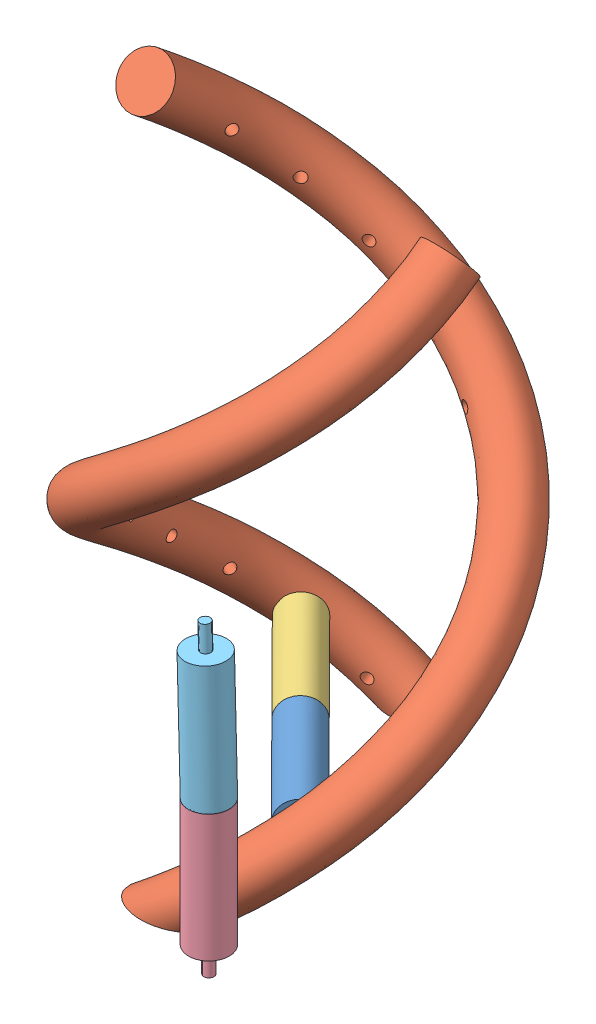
SolidWorks assembly Short_Assmbly.SLDASM, configuration Default (file format 14000). Lengths in mm.
Overall size (181.4 240.65 217.79).
5 component instances, 5 part files, 3 mates.
Components (placement in the parent):
- A nucleotide-1: A nucleotide.SLDPRT [Default] at (132.9079 -18.2171 65.2879) x (-0.018378 0.999665 0.018247) z (-0.708945 -0.025898 0.704788) size (16 70 16)
- DNA backbone_SHORT-1: DNA backbone_SHORT.SLDPRT [Default] at (90.11 -55.7539 23.2304) size (140.54 240.65 142.82)
- T nucleotide-1: T nucleotide.SLDPRT [Default] at (48.305 -18.219 -19.8141) x (-0.129883 -0.983083 0.129144) z (-0.697188 0.18316 0.693095) size (16 60 16)
- C nucleotide-2: C nucleotide.SLDPRT [Default] at (193.0818 15.3819 161.2789) size (16 68 16)
- G nucleotide-2: G nucleotide.SLDPRT [Default] at (191.7437 135.3668 161.4533) x (0.99955 0.02224 0.020147) z (0.020077 0.003354 -0.999793) size (16 60 16)
Mates (geometry in assembly coordinates):
- Coincident11: coincident anti-aligned: cone of A nucleotide-1 through (90.6065 -18.2181 22.7369) axis (-0.705024 -0.000016 -0.709183); circle of T nucleotide-1
- Coincident15: coincident aligned: plane of DNA backbone_SHORT-1 through (47.8076 -18.3931 -19.3197) normal (0.705024 0.000016 0.709183); circle of T nucleotide-1
- Concentric13: concentric: sphere of C nucleotide-2; sphere of G nucleotide-2
